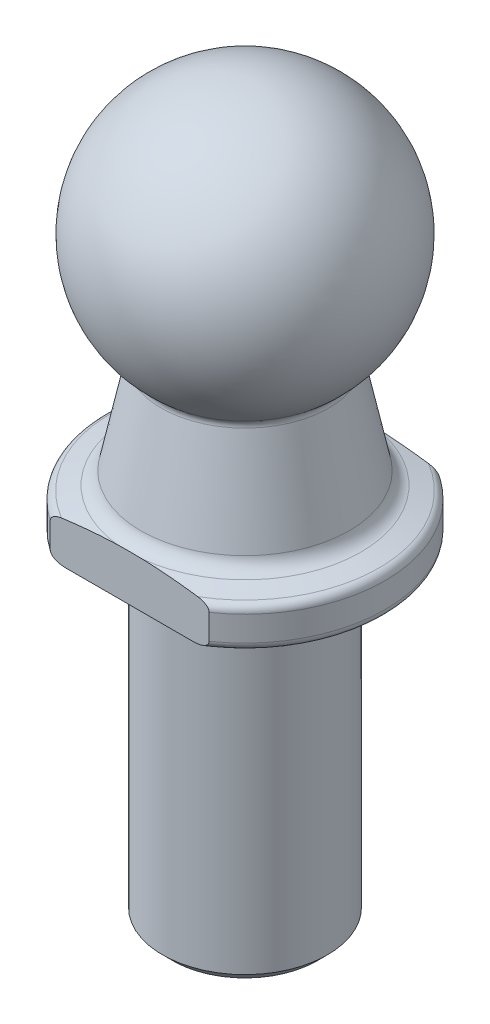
from build123d import *

# Parameters (mm, degrees)
ESQUISSE7_W             = 23.124431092
ESQUISSE7_H             = 10.0672646
ESQUISSE7_W_2           = 24.411224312
ESQUISSE7_H_2           = 5.109326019
ENL_V_MAT_EXTRU_2_DEPTH = 5.5


with BuildPart() as part:
    # Esquisse5 → R_volution3 (revolve)
    with BuildSketch(Plane.XY, mode=Mode.PRIVATE) as r_volution3_sk:
        with BuildLine():
            Line((-14.444188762, 8), (-14.444188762, -36))
            Line((-14.444188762, -36), (-18.844188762, -36))
            Line((-18.844188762, -36), (-19.444188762, -35.4))
            Line((-19.444188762, -35.4), (-19.444188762, -16))
            Line((-19.444188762, -16), (-22.444188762, -16))
            ThreePointArc((-22.444188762, -16), (-22.797742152, -15.853553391), (-22.944188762, -15.5))
            Line((-22.944188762, -15.5), (-22.944188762, -13.983663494))
            ThreePointArc((-22.944188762, -13.983663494), (-22.840865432, -13.679282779), (-22.573598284, -13.500700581))
            Line((-22.573598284, -13.500700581), (-21.482500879, -13.208341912))
            ThreePointArc((-21.482500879, -13.208341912), (-21.015284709, -12.930073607), (-20.762774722, -12.448448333))
            Line((-20.762774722, -12.448448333), (-19.534122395, -6.612993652))
            ThreePointArc((-19.534122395, -6.612993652), (-19.549691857, -6.349960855), (-19.696815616, -6.131367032))
            ThreePointArc((-19.696815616, -6.131367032), (-22.057828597, 2.788104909), (-14.444188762, 8))
        make_face()
    revolve(r_volution3_sk.sketch.rotate(Axis((-14.444188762, 8, 0), (0, 1, 0)), 270), axis=Axis((-14.444188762, 8, 0), (0, 1, 0)))

    # Esquisse7 → Enl_v. mat.-Extru.2 (cut)
    with BuildSketch(Plane.XZ.offset(16)):
        with Locations((-9.402279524, 12.0336323)):
            Rectangle(ESQUISSE7_W, ESQUISSE7_H)
        with Locations((-10.045676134, -9.55466301)):
            Rectangle(ESQUISSE7_W_2, ESQUISSE7_H_2)
    extrude(amount=-ENL_V_MAT_EXTRU_2_DEPTH, mode=Mode.SUBTRACT)


solid = part.part
